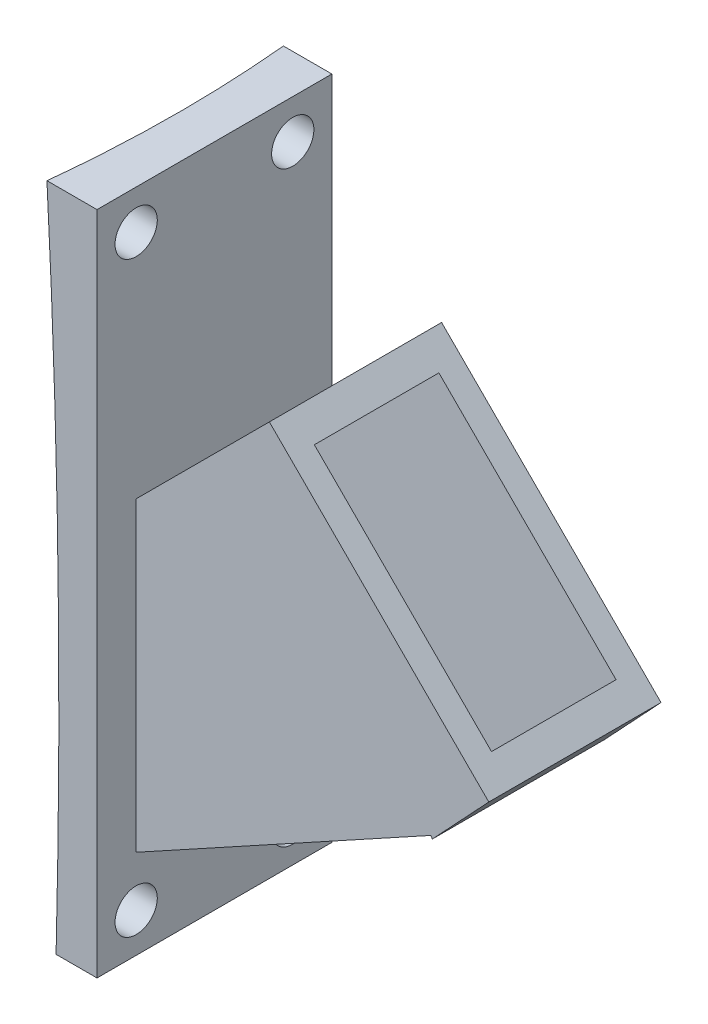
ISO-10303-21;
HEADER;
FILE_DESCRIPTION(('STEP AP214'),'2;1');
FILE_NAME('part.step','',(''),(''),'','','');
FILE_SCHEMA(('AUTOMOTIVE_DESIGN { 1 0 10303 214 1 1 1 1 }'));
ENDSEC;
DATA;
#1=APPLICATION_CONTEXT('core data for automotive mechanical design processes');
#2=APPLICATION_PROTOCOL_DEFINITION('international standard','automotive_design',2000,#1);
#3=PRODUCT_CONTEXT('',#1,'mechanical');
#4=PRODUCT('Part','Part','',(#3));
#5=PRODUCT_RELATED_PRODUCT_CATEGORY('part','',(#4));
#6=PRODUCT_DEFINITION_FORMATION('','',#4);
#7=PRODUCT_DEFINITION_CONTEXT('part definition',#1,'design');
#8=PRODUCT_DEFINITION('design','',#6,#7);
#9=PRODUCT_DEFINITION_SHAPE('','',#8);
#10=(LENGTH_UNIT() NAMED_UNIT(*) SI_UNIT(.MILLI.,.METRE.));
#11=(NAMED_UNIT(*) PLANE_ANGLE_UNIT() SI_UNIT($,.RADIAN.));
#12=(NAMED_UNIT(*) SI_UNIT($,.STERADIAN.) SOLID_ANGLE_UNIT());
#13=UNCERTAINTY_MEASURE_WITH_UNIT(LENGTH_MEASURE(1.E-05),#10,'distance_accuracy_value','');
#14=(GEOMETRIC_REPRESENTATION_CONTEXT(3) GLOBAL_UNCERTAINTY_ASSIGNED_CONTEXT((#13)) GLOBAL_UNIT_ASSIGNED_CONTEXT((#10,
#11,#12)) REPRESENTATION_CONTEXT('',''));
#15=CARTESIAN_POINT('',(0.,0.,0.));
#16=DIRECTION('',(0.,0.,1.));
#17=DIRECTION('',(1.,0.,0.));
#18=AXIS2_PLACEMENT_3D('',#15,#16,#17);
#19=CARTESIAN_POINT('',(13.8669999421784,72.7650266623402,-17.78));
#20=DIRECTION('',(1.,0.,0.));
#21=DIRECTION('',(0.,1.,0.));
#22=AXIS2_PLACEMENT_3D('',#19,#20,#21);
#23=PLANE('',#22);
#24=CARTESIAN_POINT('',(13.8669999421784,-28.8349733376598,-11.43));
#25=DIRECTION('',(1.,0.,0.));
#26=DIRECTION('',(0.,1.,0.));
#27=AXIS2_PLACEMENT_3D('',#24,#25,#26);
#28=CIRCLE('',#27,3.429);
#29=CARTESIAN_POINT('',(13.8669999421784,-25.4059733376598,-11.43));
#30=VERTEX_POINT('',#29);
#31=EDGE_CURVE('E172',#30,#30,#28,.T.);
#32=ORIENTED_EDGE('',*,*,#31,.F.);
#33=EDGE_LOOP('',(#32));
#34=FACE_BOUND('',#33,.T.);
#35=CARTESIAN_POINT('',(13.8669999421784,66.4150266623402,-11.43));
#36=DIRECTION('',(1.,0.,0.));
#37=DIRECTION('',(0.,1.,0.));
#38=AXIS2_PLACEMENT_3D('',#35,#36,#37);
#39=CIRCLE('',#38,3.429);
#40=CARTESIAN_POINT('',(13.8669999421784,69.8440266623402,-11.43));
#41=VERTEX_POINT('',#40);
#42=EDGE_CURVE('E180',#41,#41,#39,.T.);
#43=ORIENTED_EDGE('',*,*,#42,.F.);
#44=EDGE_LOOP('',(#43));
#45=FACE_BOUND('',#44,.T.);
#46=CARTESIAN_POINT('',(13.8669999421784,66.4150266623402,13.97));
#47=DIRECTION('',(1.,0.,0.));
#48=DIRECTION('',(0.,1.,0.));
#49=AXIS2_PLACEMENT_3D('',#46,#47,#48);
#50=CIRCLE('',#49,3.429);
#51=CARTESIAN_POINT('',(13.8669999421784,69.8440266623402,13.97));
#52=VERTEX_POINT('',#51);
#53=EDGE_CURVE('E176',#52,#52,#50,.T.);
#54=ORIENTED_EDGE('',*,*,#53,.F.);
#55=EDGE_LOOP('',(#54));
#56=FACE_BOUND('',#55,.T.);
#57=CARTESIAN_POINT('',(13.8669999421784,-28.8349733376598,13.97));
#58=DIRECTION('',(1.,0.,0.));
#59=DIRECTION('',(0.,1.,0.));
#60=AXIS2_PLACEMENT_3D('',#57,#58,#59);
#61=CIRCLE('',#60,3.429);
#62=CARTESIAN_POINT('',(13.8669999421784,-25.4059733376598,13.97));
#63=VERTEX_POINT('',#62);
#64=EDGE_CURVE('E179',#63,#63,#61,.T.);
#65=ORIENTED_EDGE('',*,*,#64,.F.);
#66=EDGE_LOOP('',(#65));
#67=FACE_BOUND('',#66,.T.);
#68=DIRECTION('',(0.,1.,0.));
#69=VECTOR('',#68,1.);
#70=CARTESIAN_POINT('',(13.8669999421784,72.7650266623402,20.32));
#71=LINE('',#70,#69);
#72=CARTESIAN_POINT('',(13.8669999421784,-35.1849733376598,20.32));
#73=VERTEX_POINT('',#72);
#74=CARTESIAN_POINT('',(13.8669999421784,72.7650266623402,20.32));
#75=VERTEX_POINT('',#74);
#76=EDGE_CURVE('E516',#73,#75,#71,.T.);
#77=ORIENTED_EDGE('',*,*,#76,.F.);
#78=DIRECTION('',(0.,0.,1.));
#79=VECTOR('',#78,1.);
#80=CARTESIAN_POINT('',(13.8669999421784,-35.1849733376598,-17.78));
#81=LINE('',#80,#79);
#82=CARTESIAN_POINT('',(13.8669999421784,-35.1849733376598,-17.78));
#83=VERTEX_POINT('',#82);
#84=EDGE_CURVE('E523',#83,#73,#81,.T.);
#85=ORIENTED_EDGE('',*,*,#84,.F.);
#86=DIRECTION('',(0.,1.,0.));
#87=VECTOR('',#86,1.);
#88=CARTESIAN_POINT('',(13.8669999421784,72.7650266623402,-17.78));
#89=LINE('',#88,#87);
#90=CARTESIAN_POINT('',(13.8669999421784,72.7650266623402,-17.78));
#91=VERTEX_POINT('',#90);
#92=EDGE_CURVE('E510',#83,#91,#89,.T.);
#93=ORIENTED_EDGE('',*,*,#92,.T.);
#94=DIRECTION('',(0.,0.,1.));
#95=VECTOR('',#94,1.);
#96=CARTESIAN_POINT('',(13.8669999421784,72.7650266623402,-17.78));
#97=LINE('',#96,#95);
#98=EDGE_CURVE('E505',#91,#75,#97,.T.);
#99=ORIENTED_EDGE('',*,*,#98,.T.);
#100=EDGE_LOOP('',(#77,#85,#93,#99));
#101=FACE_BOUND('',#100,.T.);
#102=DIRECTION('',(0.,-1.,0.));
#103=VECTOR('',#102,1.);
#104=CARTESIAN_POINT('',(13.8669999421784,0.,-13.97));
#105=LINE('',#104,#103);
#106=CARTESIAN_POINT('',(13.8669999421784,28.959,-13.97));
#107=VERTEX_POINT('',#106);
#108=CARTESIAN_POINT('',(13.8669999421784,-20.6945064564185,-13.97));
#109=VERTEX_POINT('',#108);
#110=EDGE_CURVE('E526',#107,#109,#105,.T.);
#111=ORIENTED_EDGE('',*,*,#110,.T.);
#112=DIRECTION('',(0.,0.,-1.));
#113=VECTOR('',#112,1.);
#114=CARTESIAN_POINT('',(13.8669999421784,-20.6945064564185,13.97));
#115=LINE('',#114,#113);
#116=CARTESIAN_POINT('',(13.8669999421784,-20.6945064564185,13.97));
#117=VERTEX_POINT('',#116);
#118=EDGE_CURVE('E329',#117,#109,#115,.T.);
#119=ORIENTED_EDGE('',*,*,#118,.F.);
#120=DIRECTION('',(0.,-1.,0.));
#121=VECTOR('',#120,1.);
#122=CARTESIAN_POINT('',(13.8669999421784,0.,13.97));
#123=LINE('',#122,#121);
#124=CARTESIAN_POINT('',(13.8669999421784,28.959,13.97));
#125=VERTEX_POINT('',#124);
#126=EDGE_CURVE('E529',#125,#117,#123,.T.);
#127=ORIENTED_EDGE('',*,*,#126,.F.);
#128=DIRECTION('',(0.,0.,-1.));
#129=VECTOR('',#128,1.);
#130=CARTESIAN_POINT('',(13.8669999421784,28.959,13.97));
#131=LINE('',#130,#129);
#132=EDGE_CURVE('E531',#125,#107,#131,.T.);
#133=ORIENTED_EDGE('',*,*,#132,.T.);
#134=EDGE_LOOP('',(#111,#119,#127,#133));
#135=FACE_BOUND('',#134,.T.);
#136=ADVANCED_FACE('F36',(#34,#45,#56,#67,#101,#135),#23,.T.);
#137=CARTESIAN_POINT('',(13.8669999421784,-35.1849733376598,-17.78));
#138=DIRECTION('',(0.,-1.,0.));
#139=DIRECTION('',(0.,0.,-1.));
#140=AXIS2_PLACEMENT_3D('',#137,#138,#139);
#141=PLANE('',#140);
#142=DIRECTION('',(1.,0.,0.));
#143=VECTOR('',#142,1.);
#144=CARTESIAN_POINT('',(13.8669999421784,-35.1849733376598,20.32));
#145=LINE('',#144,#143);
#146=CARTESIAN_POINT('',(7.22642653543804,-35.1849733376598,20.32));
#147=VERTEX_POINT('',#146);
#148=EDGE_CURVE('E513',#147,#73,#145,.T.);
#149=ORIENTED_EDGE('',*,*,#148,.F.);
#150=CARTESIAN_POINT('',(7.22642653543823,-35.1849733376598,20.32));
#151=CARTESIAN_POINT('',(7.34022612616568,-35.1849733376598,19.2632239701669));
#152=CARTESIAN_POINT('',(7.44523026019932,-35.1849733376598,18.2054996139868));
#153=CARTESIAN_POINT('',(7.6374214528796,-35.1849733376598,16.089929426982));
#154=CARTESIAN_POINT('',(7.72463329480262,-35.1849733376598,15.0320858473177));
#155=CARTESIAN_POINT('',(7.88124529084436,-35.1849733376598,12.9162772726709));
#156=CARTESIAN_POINT('',(7.95066537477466,-35.1849733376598,11.8583137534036));
#157=CARTESIAN_POINT('',(8.07170177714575,-35.1849733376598,9.74226643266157));
#158=CARTESIAN_POINT('',(8.12333310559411,-35.1849733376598,8.68418348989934));
#159=CARTESIAN_POINT('',(8.20879669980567,-35.1849733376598,6.56789781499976));
#160=CARTESIAN_POINT('',(8.24263900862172,-35.1849733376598,5.50969548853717));
#161=CARTESIAN_POINT('',(8.29252756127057,-35.1849733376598,3.39317135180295));
#162=CARTESIAN_POINT('',(8.30857884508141,-35.1849733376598,2.33484966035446));
#163=CARTESIAN_POINT('',(8.32288622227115,-35.1849733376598,0.218083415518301));
#164=CARTESIAN_POINT('',(8.32114227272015,-35.1849733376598,-0.840361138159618));
#165=CARTESIAN_POINT('',(8.29985786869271,-35.1849733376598,-2.95737001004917));
#166=CARTESIAN_POINT('',(8.28031239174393,-35.1849733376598,-4.01593427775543));
#167=CARTESIAN_POINT('',(8.22342158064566,-35.1849733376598,-6.13318229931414));
#168=CARTESIAN_POINT('',(8.18606620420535,-35.1849733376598,-7.19186578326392));
#169=CARTESIAN_POINT('',(8.0935505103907,-35.1849733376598,-9.30935212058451));
#170=CARTESIAN_POINT('',(8.03837515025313,-35.1849733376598,-10.3681543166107));
#171=CARTESIAN_POINT('',(7.91021109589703,-35.1849733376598,-12.4858777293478));
#172=CARTESIAN_POINT('',(7.83720238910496,-35.1849733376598,-13.5447977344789));
#173=CARTESIAN_POINT('',(7.6733657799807,-35.1849733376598,-15.662757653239));
#174=CARTESIAN_POINT('',(7.58251294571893,-35.1849733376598,-16.7217956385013));
#175=CARTESIAN_POINT('',(7.482821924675,-35.1849733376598,-17.7800000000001));
#176=B_SPLINE_CURVE_WITH_KNOTS('',3,(#150,#151,#152,#153,#154,#155,#156,#157,#158,#159,#160,
#161,#162,#163,#164,#165,#166,#167,#168,#169,#170,#171,#172,#173,#174,#175),.UNSPECIFIED.,.F.,
.F.,(4,2,2,2,2,2,2,2,2,2,2,2,4),(0.,3.18862189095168,6.37277149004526,9.55333855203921,
12.7312152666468,15.9072959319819,19.0824766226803,22.2576649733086,25.4337494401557,
28.6116268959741,31.7921940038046,34.9763468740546,38.1649807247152),.UNSPECIFIED.);
#177=CARTESIAN_POINT('',(7.482821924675,-35.1849733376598,-17.78));
#178=VERTEX_POINT('',#177);
#179=EDGE_CURVE('E215',#147,#178,#176,.T.);
#180=ORIENTED_EDGE('',*,*,#179,.T.);
#181=DIRECTION('',(1.,0.,0.));
#182=VECTOR('',#181,1.);
#183=CARTESIAN_POINT('',(13.8669999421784,-35.1849733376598,-17.78));
#184=LINE('',#183,#182);
#185=EDGE_CURVE('E509',#178,#83,#184,.T.);
#186=ORIENTED_EDGE('',*,*,#185,.T.);
#187=ORIENTED_EDGE('',*,*,#84,.T.);
#188=EDGE_LOOP('',(#149,#180,#186,#187));
#189=FACE_BOUND('',#188,.T.);
#190=ADVANCED_FACE('F264',(#189),#141,.T.);
#191=CARTESIAN_POINT('',(13.8669999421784,72.7650266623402,-17.78));
#192=DIRECTION('',(0.,1.,0.));
#193=DIRECTION('',(0.,0.,1.));
#194=AXIS2_PLACEMENT_3D('',#191,#192,#193);
#195=PLANE('',#194);
#196=DIRECTION('',(-1.,0.,0.));
#197=VECTOR('',#196,1.);
#198=CARTESIAN_POINT('',(13.8669999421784,72.7650266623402,-17.78));
#199=LINE('',#198,#197);
#200=CARTESIAN_POINT('',(6.00315951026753,72.7650266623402,-17.78));
#201=VERTEX_POINT('',#200);
#202=EDGE_CURVE('E502',#91,#201,#199,.T.);
#203=ORIENTED_EDGE('',*,*,#202,.T.);
#204=CARTESIAN_POINT('',(6.00315951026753,72.7650266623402,-17.78));
#205=CARTESIAN_POINT('',(6.1029581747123,72.7650266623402,-16.7217959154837));
#206=CARTESIAN_POINT('',(6.19390924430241,72.7650266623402,-15.662756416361));
#207=CARTESIAN_POINT('',(6.35792288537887,72.7650266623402,-13.5447937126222));
#208=CARTESIAN_POINT('',(6.43101046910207,72.7650266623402,-12.4858724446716));
#209=CARTESIAN_POINT('',(6.55931288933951,72.7650266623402,-10.3681467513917));
#210=CARTESIAN_POINT('',(6.61454780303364,72.7650266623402,-9.30934354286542));
#211=CARTESIAN_POINT('',(6.70716327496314,72.7650266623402,-7.19185543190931));
#212=CARTESIAN_POINT('',(6.74455892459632,72.7650266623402,-6.13317118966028));
#213=CARTESIAN_POINT('',(6.80151100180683,72.7650266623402,-4.01592190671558));
#214=CARTESIAN_POINT('',(6.82107750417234,72.7650266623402,-2.95735713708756));
#215=CARTESIAN_POINT('',(6.84238472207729,72.7650266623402,-0.840347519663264));
#216=CARTESIAN_POINT('',(6.84413047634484,72.7650266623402,0.218097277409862));
#217=CARTESIAN_POINT('',(6.82980750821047,72.7650266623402,2.33486373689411));
#218=CARTESIAN_POINT('',(6.81373882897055,72.7650266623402,3.39318539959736));
#219=CARTESIAN_POINT('',(6.76379631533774,72.7650266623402,5.50970922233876));
#220=CARTESIAN_POINT('',(6.72991742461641,72.7650266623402,6.56791126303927));
#221=CARTESIAN_POINT('',(6.64436151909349,72.7650266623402,8.68419611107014));
#222=CARTESIAN_POINT('',(6.59267442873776,72.7650266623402,9.7422785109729));
#223=CARTESIAN_POINT('',(6.4715073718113,72.7650266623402,11.8583244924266));
#224=CARTESIAN_POINT('',(6.40201234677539,72.7650266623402,12.9162872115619));
#225=CARTESIAN_POINT('',(6.2452313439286,72.7650266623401,15.0320939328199));
#226=CARTESIAN_POINT('',(6.15792537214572,72.7650266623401,16.0899364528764));
#227=CARTESIAN_POINT('',(5.96552680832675,72.7650266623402,18.2055042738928));
#228=CARTESIAN_POINT('',(5.86040935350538,72.7650266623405,19.2632273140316));
#229=CARTESIAN_POINT('',(5.74648717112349,72.7650266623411,20.32));
#230=B_SPLINE_CURVE_WITH_KNOTS('',3,(#204,#205,#206,#207,#208,#209,#210,#211,#212,#213,#214,
#215,#216,#217,#218,#219,#220,#221,#222,#223,#224,#225,#226,#227,#228,#229),.UNSPECIFIED.,.F.,
.F.,(4,2,2,2,2,2,2,2,2,2,2,2,4),(0.,3.18866325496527,6.37283587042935,9.55341499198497,
12.731298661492,15.9073854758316,19.0825742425,22.257755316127,25.4338383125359,
28.6117212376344,31.7923003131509,34.9764696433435,38.165120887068),.UNSPECIFIED.);
#231=CARTESIAN_POINT('',(5.74648717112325,72.7650266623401,20.32));
#232=VERTEX_POINT('',#231);
#233=EDGE_CURVE('E190',#201,#232,#230,.T.);
#234=ORIENTED_EDGE('',*,*,#233,.T.);
#235=DIRECTION('',(-1.,0.,0.));
#236=VECTOR('',#235,1.);
#237=CARTESIAN_POINT('',(13.8669999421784,72.7650266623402,20.32));
#238=LINE('',#237,#236);
#239=EDGE_CURVE('E519',#75,#232,#238,.T.);
#240=ORIENTED_EDGE('',*,*,#239,.F.);
#241=ORIENTED_EDGE('',*,*,#98,.F.);
#242=EDGE_LOOP('',(#203,#234,#240,#241));
#243=FACE_BOUND('',#242,.T.);
#244=ADVANCED_FACE('F270',(#243),#195,.T.);
#245=CARTESIAN_POINT('',(0.,0.,-17.78));
#246=DIRECTION('',(0.,0.,-1.));
#247=DIRECTION('',(-1.,0.,0.));
#248=AXIS2_PLACEMENT_3D('',#245,#246,#247);
#249=PLANE('',#248);
#250=ORIENTED_EDGE('',*,*,#185,.F.);
#251=CARTESIAN_POINT('',(-1364.09900570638,0.,-17.78));
#252=DIRECTION('',(0.,0.,-1.));
#253=DIRECTION('',(-1.,0.,0.));
#254=AXIS2_PLACEMENT_3D('',#251,#252,#253);
#255=CIRCLE('',#254,1372.03305070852);
#256=EDGE_CURVE('E520',#178,#201,#255,.F.);
#257=ORIENTED_EDGE('',*,*,#256,.T.);
#258=ORIENTED_EDGE('',*,*,#202,.F.);
#259=ORIENTED_EDGE('',*,*,#92,.F.);
#260=EDGE_LOOP('',(#250,#257,#258,#259));
#261=FACE_BOUND('',#260,.T.);
#262=ADVANCED_FACE('F208',(#261),#249,.T.);
#263=CARTESIAN_POINT('',(0.,0.,20.32));
#264=DIRECTION('',(0.,0.,-1.));
#265=DIRECTION('',(-1.,0.,0.));
#266=AXIS2_PLACEMENT_3D('',#263,#264,#265);
#267=PLANE('',#266);
#268=CARTESIAN_POINT('',(-1364.09900570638,0.,20.32));
#269=DIRECTION('',(0.,0.,-1.));
#270=DIRECTION('',(-1.,0.,0.));
#271=AXIS2_PLACEMENT_3D('',#268,#269,#270);
#272=CIRCLE('',#271,1371.77673965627);
#273=EDGE_CURVE('E331',#147,#232,#272,.F.);
#274=ORIENTED_EDGE('',*,*,#273,.F.);
#275=ORIENTED_EDGE('',*,*,#148,.T.);
#276=ORIENTED_EDGE('',*,*,#76,.T.);
#277=ORIENTED_EDGE('',*,*,#239,.T.);
#278=EDGE_LOOP('',(#274,#275,#276,#277));
#279=FACE_BOUND('',#278,.T.);
#280=ADVANCED_FACE('F294',(#279),#267,.F.);
#281=CARTESIAN_POINT('',(71.0710749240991,14.9684617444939,13.97));
#282=DIRECTION('',(0.730018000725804,-0.683427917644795,0.));
#283=DIRECTION('',(0.683427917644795,0.730018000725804,0.));
#284=AXIS2_PLACEMENT_3D('',#281,#282,#283);
#285=PLANE('',#284);
#286=DIRECTION('',(0.,0.,1.));
#287=VECTOR('',#286,1.);
#288=CARTESIAN_POINT('',(61.9099897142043,5.1828546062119,13.97));
#289=LINE('',#288,#287);
#290=CARTESIAN_POINT('',(61.9099897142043,5.18285460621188,-13.97));
#291=VERTEX_POINT('',#290);
#292=CARTESIAN_POINT('',(61.9099897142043,5.18285460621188,13.97));
#293=VERTEX_POINT('',#292);
#294=EDGE_CURVE('E320',#291,#293,#289,.T.);
#295=ORIENTED_EDGE('',*,*,#294,.F.);
#296=DIRECTION('',(-0.683427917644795,-0.730018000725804,0.));
#297=VECTOR('',#296,1.);
#298=CARTESIAN_POINT('',(71.0710749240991,14.9684617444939,-13.97));
#299=LINE('',#298,#297);
#300=CARTESIAN_POINT('',(71.0710749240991,14.9684617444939,-13.97));
#301=VERTEX_POINT('',#300);
#302=EDGE_CURVE('E315',#301,#291,#299,.T.);
#303=ORIENTED_EDGE('',*,*,#302,.F.);
#304=DIRECTION('',(0.,0.,-1.));
#305=VECTOR('',#304,1.);
#306=CARTESIAN_POINT('',(71.0710749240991,14.9684617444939,13.97));
#307=LINE('',#306,#305);
#308=CARTESIAN_POINT('',(71.0710749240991,14.9684617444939,13.97));
#309=VERTEX_POINT('',#308);
#310=EDGE_CURVE('E312',#309,#301,#307,.T.);
#311=ORIENTED_EDGE('',*,*,#310,.F.);
#312=DIRECTION('',(-0.683427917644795,-0.730018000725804,0.));
#313=VECTOR('',#312,1.);
#314=CARTESIAN_POINT('',(71.0710749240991,14.9684617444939,13.97));
#315=LINE('',#314,#313);
#316=EDGE_CURVE('E327',#309,#293,#315,.T.);
#317=ORIENTED_EDGE('',*,*,#316,.T.);
#318=EDGE_LOOP('',(#295,#303,#311,#317));
#319=FACE_BOUND('',#318,.T.);
#320=ADVANCED_FACE('F291',(#319),#285,.T.);
#321=CARTESIAN_POINT('',(35.4737683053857,50.5657683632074,13.97));
#322=DIRECTION('',(0.707106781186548,0.707106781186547,0.));
#323=DIRECTION('',(-0.707106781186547,0.707106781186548,0.));
#324=AXIS2_PLACEMENT_3D('',#321,#322,#323);
#325=PLANE('',#324);
#326=DIRECTION('',(-0.707106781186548,0.707106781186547,0.));
#327=VECTOR('',#326,1.);
#328=CARTESIAN_POINT('',(38.9040118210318,47.1355248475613,-10.10031));
#329=LINE('',#328,#327);
#330=CARTESIAN_POINT('',(67.6408314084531,18.39870526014,-10.10031));
#331=VERTEX_POINT('',#330);
#332=CARTESIAN_POINT('',(38.9040118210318,47.1355248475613,-10.10031));
#333=VERTEX_POINT('',#332);
#334=EDGE_CURVE('E51',#331,#333,#329,.T.);
#335=ORIENTED_EDGE('',*,*,#334,.F.);
#336=DIRECTION('',(0.,0.,-1.));
#337=VECTOR('',#336,1.);
#338=CARTESIAN_POINT('',(67.6408314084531,18.39870526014,10.10031));
#339=LINE('',#338,#337);
#340=CARTESIAN_POINT('',(67.6408314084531,18.39870526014,10.10031));
#341=VERTEX_POINT('',#340);
#342=EDGE_CURVE('E149',#341,#331,#339,.T.);
#343=ORIENTED_EDGE('',*,*,#342,.F.);
#344=DIRECTION('',(0.707106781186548,-0.707106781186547,0.));
#345=VECTOR('',#344,1.);
#346=CARTESIAN_POINT('',(38.9040118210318,47.1355248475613,10.10031));
#347=LINE('',#346,#345);
#348=CARTESIAN_POINT('',(38.9040118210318,47.1355248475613,10.10031));
#349=VERTEX_POINT('',#348);
#350=EDGE_CURVE('E165',#349,#341,#347,.T.);
#351=ORIENTED_EDGE('',*,*,#350,.F.);
#352=DIRECTION('',(0.,0.,1.));
#353=VECTOR('',#352,1.);
#354=CARTESIAN_POINT('',(38.9040118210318,47.1355248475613,10.10031));
#355=LINE('',#354,#353);
#356=EDGE_CURVE('E163',#333,#349,#355,.T.);
#357=ORIENTED_EDGE('',*,*,#356,.F.);
#358=EDGE_LOOP('',(#335,#343,#351,#357));
#359=FACE_BOUND('',#358,.T.);
#360=DIRECTION('',(0.707106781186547,-0.707106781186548,0.));
#361=VECTOR('',#360,1.);
#362=CARTESIAN_POINT('',(35.4737683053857,50.5657683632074,-13.97));
#363=LINE('',#362,#361);
#364=CARTESIAN_POINT('',(35.4737683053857,50.5657683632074,-13.97));
#365=VERTEX_POINT('',#364);
#366=EDGE_CURVE('E307',#365,#301,#363,.T.);
#367=ORIENTED_EDGE('',*,*,#366,.F.);
#368=DIRECTION('',(0.,0.,-1.));
#369=VECTOR('',#368,1.);
#370=CARTESIAN_POINT('',(35.4737683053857,50.5657683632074,13.97));
#371=LINE('',#370,#369);
#372=CARTESIAN_POINT('',(35.4737683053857,50.5657683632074,13.97));
#373=VERTEX_POINT('',#372);
#374=EDGE_CURVE('E310',#373,#365,#371,.T.);
#375=ORIENTED_EDGE('',*,*,#374,.F.);
#376=DIRECTION('',(0.707106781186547,-0.707106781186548,0.));
#377=VECTOR('',#376,1.);
#378=CARTESIAN_POINT('',(35.4737683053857,50.5657683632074,13.97));
#379=LINE('',#378,#377);
#380=EDGE_CURVE('E546',#373,#309,#379,.T.);
#381=ORIENTED_EDGE('',*,*,#380,.T.);
#382=ORIENTED_EDGE('',*,*,#310,.T.);
#383=EDGE_LOOP('',(#367,#375,#381,#382));
#384=FACE_BOUND('',#383,.T.);
#385=ADVANCED_FACE('F293',(#359,#384),#325,.T.);
#386=CARTESIAN_POINT('',(8.53299994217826,23.6249999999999,13.97));
#387=DIRECTION('',(-0.707106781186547,0.707106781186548,0.));
#388=DIRECTION('',(-0.707106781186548,-0.707106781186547,0.));
#389=AXIS2_PLACEMENT_3D('',#386,#387,#388);
#390=PLANE('',#389);
#391=ORIENTED_EDGE('',*,*,#132,.F.);
#392=DIRECTION('',(0.707106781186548,0.707106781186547,0.));
#393=VECTOR('',#392,1.);
#394=CARTESIAN_POINT('',(8.53299994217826,23.6249999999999,13.97));
#395=LINE('',#394,#393);
#396=EDGE_CURVE('E318',#125,#373,#395,.T.);
#397=ORIENTED_EDGE('',*,*,#396,.T.);
#398=ORIENTED_EDGE('',*,*,#374,.T.);
#399=DIRECTION('',(0.707106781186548,0.707106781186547,0.));
#400=VECTOR('',#399,1.);
#401=CARTESIAN_POINT('',(8.53299994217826,23.6249999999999,-13.97));
#402=LINE('',#401,#400);
#403=EDGE_CURVE('E316',#107,#365,#402,.T.);
#404=ORIENTED_EDGE('',*,*,#403,.F.);
#405=EDGE_LOOP('',(#391,#397,#398,#404));
#406=FACE_BOUND('',#405,.T.);
#407=ADVANCED_FACE('F38',(#406),#390,.T.);
#408=CARTESIAN_POINT('',(0.,0.,13.97));
#409=DIRECTION('',(0.,0.,-1.));
#410=DIRECTION('',(-1.,0.,0.));
#411=AXIS2_PLACEMENT_3D('',#408,#409,#410);
#412=PLANE('',#411);
#413=ORIENTED_EDGE('',*,*,#126,.T.);
#414=DIRECTION('',(0.876438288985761,0.48151420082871,0.));
#415=VECTOR('',#414,1.);
#416=CARTESIAN_POINT('',(61.6722651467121,5.5696519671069,13.97));
#417=LINE('',#416,#415);
#418=CARTESIAN_POINT('',(61.6722651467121,5.5696519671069,13.97));
#419=VERTEX_POINT('',#418);
#420=EDGE_CURVE('E538',#117,#419,#417,.T.);
#421=ORIENTED_EDGE('',*,*,#420,.T.);
#422=DIRECTION('',(0.523610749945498,-0.851957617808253,0.));
#423=VECTOR('',#422,1.);
#424=CARTESIAN_POINT('',(79.6160038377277,-23.626281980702,13.97));
#425=LINE('',#424,#423);
#426=EDGE_CURVE('E535',#419,#293,#425,.T.);
#427=ORIENTED_EDGE('',*,*,#426,.T.);
#428=ORIENTED_EDGE('',*,*,#316,.F.);
#429=ORIENTED_EDGE('',*,*,#380,.F.);
#430=ORIENTED_EDGE('',*,*,#396,.F.);
#431=EDGE_LOOP('',(#413,#421,#427,#428,#429,#430));
#432=FACE_BOUND('',#431,.T.);
#433=ADVANCED_FACE('F284',(#432),#412,.F.);
#434=CARTESIAN_POINT('',(0.,0.,-13.97));
#435=DIRECTION('',(0.,0.,-1.));
#436=DIRECTION('',(-1.,0.,0.));
#437=AXIS2_PLACEMENT_3D('',#434,#435,#436);
#438=PLANE('',#437);
#439=ORIENTED_EDGE('',*,*,#110,.F.);
#440=ORIENTED_EDGE('',*,*,#403,.T.);
#441=ORIENTED_EDGE('',*,*,#366,.T.);
#442=ORIENTED_EDGE('',*,*,#302,.T.);
#443=DIRECTION('',(0.523610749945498,-0.851957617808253,0.));
#444=VECTOR('',#443,1.);
#445=CARTESIAN_POINT('',(79.6160038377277,-23.626281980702,-13.97));
#446=LINE('',#445,#444);
#447=CARTESIAN_POINT('',(61.6722651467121,5.5696519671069,-13.97));
#448=VERTEX_POINT('',#447);
#449=EDGE_CURVE('E533',#448,#291,#446,.T.);
#450=ORIENTED_EDGE('',*,*,#449,.F.);
#451=DIRECTION('',(0.876438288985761,0.48151420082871,0.));
#452=VECTOR('',#451,1.);
#453=CARTESIAN_POINT('',(11.9485896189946,-21.7484789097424,-13.97));
#454=LINE('',#453,#452);
#455=EDGE_CURVE('E325',#109,#448,#454,.T.);
#456=ORIENTED_EDGE('',*,*,#455,.F.);
#457=EDGE_LOOP('',(#439,#440,#441,#442,#450,#456));
#458=FACE_BOUND('',#457,.T.);
#459=ADVANCED_FACE('F279',(#458),#438,.T.);
#460=CARTESIAN_POINT('',(61.6722651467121,5.5696519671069,13.97));
#461=DIRECTION('',(-0.48151420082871,0.876438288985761,0.));
#462=DIRECTION('',(-0.876438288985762,-0.48151420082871,0.));
#463=AXIS2_PLACEMENT_3D('',#460,#461,#462);
#464=PLANE('',#463);
#465=DIRECTION('',(0.,0.,-1.));
#466=VECTOR('',#465,1.);
#467=CARTESIAN_POINT('',(46.4470770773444,-2.79504907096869,13.97));
#468=LINE('',#467,#466);
#469=CARTESIAN_POINT('',(46.4470770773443,-2.79504907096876,10.10031));
#470=VERTEX_POINT('',#469);
#471=CARTESIAN_POINT('',(46.4470770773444,-2.79504907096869,-10.10031));
#472=VERTEX_POINT('',#471);
#473=EDGE_CURVE('E44',#470,#472,#468,.T.);
#474=ORIENTED_EDGE('',*,*,#473,.T.);
#475=DIRECTION('',(-0.876438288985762,-0.48151420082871,0.));
#476=VECTOR('',#475,1.);
#477=CARTESIAN_POINT('',(61.6722651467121,5.5696519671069,-10.10031));
#478=LINE('',#477,#476);
#479=CARTESIAN_POINT('',(39.0286980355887,-6.87069809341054,-10.10031));
#480=VERTEX_POINT('',#479);
#481=EDGE_CURVE('E11',#472,#480,#478,.T.);
#482=ORIENTED_EDGE('',*,*,#481,.T.);
#483=DIRECTION('',(0.,0.,-1.));
#484=VECTOR('',#483,1.);
#485=CARTESIAN_POINT('',(39.0286980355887,-6.87069809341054,13.97));
#486=LINE('',#485,#484);
#487=CARTESIAN_POINT('',(39.0286980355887,-6.87069809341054,10.10031));
#488=VERTEX_POINT('',#487);
#489=EDGE_CURVE('E148',#488,#480,#486,.T.);
#490=ORIENTED_EDGE('',*,*,#489,.F.);
#491=DIRECTION('',(0.876438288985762,0.48151420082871,0.));
#492=VECTOR('',#491,1.);
#493=CARTESIAN_POINT('',(61.6722651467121,5.5696519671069,10.10031));
#494=LINE('',#493,#492);
#495=EDGE_CURVE('E335',#488,#470,#494,.T.);
#496=ORIENTED_EDGE('',*,*,#495,.T.);
#497=EDGE_LOOP('',(#474,#482,#490,#496));
#498=FACE_BOUND('',#497,.T.);
#499=ORIENTED_EDGE('',*,*,#118,.T.);
#500=ORIENTED_EDGE('',*,*,#455,.T.);
#501=DIRECTION('',(0.,0.,-1.));
#502=VECTOR('',#501,1.);
#503=CARTESIAN_POINT('',(61.6722651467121,5.5696519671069,13.97));
#504=LINE('',#503,#502);
#505=EDGE_CURVE('E541',#419,#448,#504,.T.);
#506=ORIENTED_EDGE('',*,*,#505,.F.);
#507=ORIENTED_EDGE('',*,*,#420,.F.);
#508=EDGE_LOOP('',(#499,#500,#506,#507));
#509=FACE_BOUND('',#508,.T.);
#510=ADVANCED_FACE('F276',(#498,#509),#464,.F.);
#511=CARTESIAN_POINT('',(79.6160038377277,-23.626281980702,13.97));
#512=DIRECTION('',(0.851957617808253,0.523610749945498,0.));
#513=DIRECTION('',(-0.523610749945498,0.851957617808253,0.));
#514=AXIS2_PLACEMENT_3D('',#511,#512,#513);
#515=PLANE('',#514);
#516=ORIENTED_EDGE('',*,*,#294,.T.);
#517=ORIENTED_EDGE('',*,*,#426,.F.);
#518=ORIENTED_EDGE('',*,*,#505,.T.);
#519=ORIENTED_EDGE('',*,*,#449,.T.);
#520=EDGE_LOOP('',(#516,#517,#518,#519));
#521=FACE_BOUND('',#520,.T.);
#522=ADVANCED_FACE('F204',(#521),#515,.F.);
#523=CARTESIAN_POINT('',(-1364.09900570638,0.,0.));
#524=DIRECTION('',(0.,1.,0.));
#525=DIRECTION('',(1.,0.,0.));
#526=AXIS2_PLACEMENT_3D('',#523,#524,#525);
#527=ELLIPSE('',#526,1372.87,509.27);
#528=TRIMMED_CURVE('',#527,(PARAMETER_VALUE(4.71238898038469)),
(PARAMETER_VALUE(7.85398163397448)),.T.,.PARAMETER.);
#529=CARTESIAN_POINT('',(-1364.09900570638,0.,-509.27));
#530=DIRECTION('',(0.,0.,-1.));
#531=AXIS1_PLACEMENT('',#529,#530);
#532=SURFACE_OF_REVOLUTION('',#528,#531);
#533=CARTESIAN_POINT('',(8.19001653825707,-25.4059733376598,-11.43));
#534=CARTESIAN_POINT('',(8.17832953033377,-25.4059819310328,-11.6230721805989));
#535=CARTESIAN_POINT('',(8.16603520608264,-25.4223345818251,-11.8162495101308));
#536=CARTESIAN_POINT('',(8.14060734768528,-25.4873090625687,-12.1972092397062));
#537=CARTESIAN_POINT('',(8.12747280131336,-25.5359705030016,-12.3849847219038));
#538=CARTESIAN_POINT('',(8.10081646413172,-25.6641554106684,-12.7495665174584));
#539=CARTESIAN_POINT('',(8.08729488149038,-25.7436625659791,-12.9263785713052));
#540=CARTESIAN_POINT('',(8.06034273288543,-25.9312623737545,-13.2640686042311));
#541=CARTESIAN_POINT('',(8.04691214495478,-26.0393478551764,-13.4249505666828));
#542=CARTESIAN_POINT('',(8.02062952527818,-26.281147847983,-13.7263823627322));
#543=CARTESIAN_POINT('',(8.00777790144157,-26.414880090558,-13.8669180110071));
#544=CARTESIAN_POINT('',(7.98315841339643,-26.7041559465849,-14.1235182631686));
#545=CARTESIAN_POINT('',(7.9713905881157,-26.8597003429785,-14.2395819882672));
#546=CARTESIAN_POINT('',(7.94941484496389,-27.1879846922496,-14.443766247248));
#547=CARTESIAN_POINT('',(7.93920496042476,-27.3607025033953,-14.5319221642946));
#548=CARTESIAN_POINT('',(7.92072601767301,-27.7185991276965,-14.6779378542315));
#549=CARTESIAN_POINT('',(7.91245692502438,-27.9037777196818,-14.7357981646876));
#550=CARTESIAN_POINT('',(7.8981934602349,-28.2807753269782,-14.8194068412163));
#551=CARTESIAN_POINT('',(7.89219264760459,-28.472573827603,-14.8452466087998));
#552=CARTESIAN_POINT('',(7.88264049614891,-28.8578459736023,-14.8643435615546));
#553=CARTESIAN_POINT('',(7.87908911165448,-29.0513195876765,-14.8576013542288));
#554=CARTESIAN_POINT('',(7.87453615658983,-29.4338958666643,-14.8117672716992));
#555=CARTESIAN_POINT('',(7.87352773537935,-29.6230089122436,-14.7727626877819));
#556=CARTESIAN_POINT('',(7.87401918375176,-29.9920224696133,-14.6636200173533));
#557=CARTESIAN_POINT('',(7.87551903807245,-30.1719230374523,-14.5934821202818));
#558=CARTESIAN_POINT('',(7.88089442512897,-30.5172546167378,-14.4241479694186));
#559=CARTESIAN_POINT('',(7.88476794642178,-30.682697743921,-14.3249763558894));
#560=CARTESIAN_POINT('',(7.89466459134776,-30.9946117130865,-14.1003814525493));
#561=CARTESIAN_POINT('',(7.90068772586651,-31.1410824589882,-13.9749580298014));
#562=CARTESIAN_POINT('',(7.91459425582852,-31.4111124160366,-13.7012455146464));
#563=CARTESIAN_POINT('',(7.92248010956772,-31.5346409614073,-13.5529262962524));
#564=CARTESIAN_POINT('',(7.93975694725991,-31.7550834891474,-13.2377558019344));
#565=CARTESIAN_POINT('',(7.94914795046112,-31.8519971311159,-13.0709042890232));
#566=CARTESIAN_POINT('',(7.9690817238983,-32.0167036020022,-12.7229689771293));
#567=CARTESIAN_POINT('',(7.97962720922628,-32.0844258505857,-12.5418519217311));
#568=CARTESIAN_POINT('',(8.00146794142,-32.1885203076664,-12.1708654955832));
#569=CARTESIAN_POINT('',(8.01276319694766,-32.224892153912,-11.9809960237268));
#570=CARTESIAN_POINT('',(8.03575969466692,-32.2653148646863,-11.597483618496));
#571=CARTESIAN_POINT('',(8.04746170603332,-32.2693007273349,-11.4038338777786));
#572=CARTESIAN_POINT('',(8.07091311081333,-32.2446738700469,-11.0186209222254));
#573=CARTESIAN_POINT('',(8.08266250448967,-32.2160609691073,-10.8270577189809));
#574=CARTESIAN_POINT('',(8.10592265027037,-32.1270088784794,-10.4513003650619));
#575=CARTESIAN_POINT('',(8.1174332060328,-32.0665445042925,-10.2671121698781));
#576=CARTESIAN_POINT('',(8.13995577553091,-31.9154817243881,-9.91150465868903));
#577=CARTESIAN_POINT('',(8.15096778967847,-31.8248833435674,-9.74008533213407));
#578=CARTESIAN_POINT('',(8.17228331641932,-31.6161516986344,-9.41495811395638));
#579=CARTESIAN_POINT('',(8.18258707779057,-31.49802816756,-9.26124399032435));
#580=CARTESIAN_POINT('',(8.20232212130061,-31.2375740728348,-8.97584592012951));
#581=CARTESIAN_POINT('',(8.21175340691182,-31.0952436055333,-8.84416188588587));
#582=CARTESIAN_POINT('',(8.22959485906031,-30.7905674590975,-8.60671142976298));
#583=CARTESIAN_POINT('',(8.23800603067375,-30.6282418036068,-8.50091939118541));
#584=CARTESIAN_POINT('',(8.25369662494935,-30.2880719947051,-8.31811508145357));
#585=CARTESIAN_POINT('',(8.26097605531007,-30.1102279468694,-8.24110261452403));
#586=CARTESIAN_POINT('',(8.27428173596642,-29.7442975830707,-8.11814517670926));
#587=CARTESIAN_POINT('',(8.28030946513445,-29.5562236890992,-8.07216339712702));
#588=CARTESIAN_POINT('',(8.29101009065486,-29.1749859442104,-8.01244842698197));
#589=CARTESIAN_POINT('',(8.29568299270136,-28.981822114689,-7.99871510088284));
#590=CARTESIAN_POINT('',(8.3035540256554,-28.5961241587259,-8.00390201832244));
#591=CARTESIAN_POINT('',(8.30675383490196,-28.4035895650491,-8.02278498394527));
#592=CARTESIAN_POINT('',(8.31156993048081,-28.0244029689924,-8.09260873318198));
#593=CARTESIAN_POINT('',(8.31318622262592,-27.8377509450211,-8.1435493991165));
#594=CARTESIAN_POINT('',(8.31472268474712,-27.4758073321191,-8.27598495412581));
#595=CARTESIAN_POINT('',(8.31464440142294,-27.3005055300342,-8.35745191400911));
#596=CARTESIAN_POINT('',(8.31269932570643,-26.9660639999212,-8.5486260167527));
#597=CARTESIAN_POINT('',(8.31083261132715,-26.8069235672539,-8.65833192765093));
#598=CARTESIAN_POINT('',(8.30524570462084,-26.5093999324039,-8.90278807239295));
#599=CARTESIAN_POINT('',(8.30152657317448,-26.3710049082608,-9.03752394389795));
#600=CARTESIAN_POINT('',(8.29221194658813,-26.1187462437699,-9.32828665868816));
#601=CARTESIAN_POINT('',(8.28661598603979,-26.0048886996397,-9.48431877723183));
#602=CARTESIAN_POINT('',(8.27358175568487,-25.8048744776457,-9.81332056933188));
#603=CARTESIAN_POINT('',(8.26614191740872,-25.7187415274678,-9.98630458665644));
#604=CARTESIAN_POINT('',(8.24953711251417,-25.5767980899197,-10.3440514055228));
#605=CARTESIAN_POINT('',(8.24037421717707,-25.5209515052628,-10.5287998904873));
#606=CARTESIAN_POINT('',(8.22426339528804,-25.4560474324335,-10.8339352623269));
#607=CARTESIAN_POINT('',(8.21778002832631,-25.4372905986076,-10.9523716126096));
#608=CARTESIAN_POINT('',(8.20428117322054,-25.4122508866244,-11.190525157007));
#609=CARTESIAN_POINT('',(8.19726568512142,-25.4059680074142,-11.3102423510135));
#610=CARTESIAN_POINT('',(8.19001653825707,-25.4059733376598,-11.43));
#611=B_SPLINE_CURVE_WITH_KNOTS('',3,(#533,#534,#535,#536,#537,#538,#539,#540,#541,#542,#543,
#544,#545,#546,#547,#548,#549,#550,#551,#552,#553,#554,#555,#556,#557,#558,#559,#560,#561,#562,
#563,#564,#565,#566,#567,#568,#569,#570,#571,#572,#573,#574,#575,#576,#577,#578,#579,#580,#581,
#582,#583,#584,#585,#586,#587,#588,#589,#590,#591,#592,#593,#594,#595,#596,#597,#598,#599,#600,
#601,#602,#603,#604,#605,#606,#607,#608,#609,#610),.UNSPECIFIED.,.T.,.F.,(4,2,2,2,2,2,2,2,2,2,2,
2,2,2,2,2,2,2,2,2,2,2,2,2,2,2,2,2,2,2,2,2,2,2,2,2,2,2,4),(0.,0.579838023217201,1.16038824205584,
1.74063187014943,2.32073003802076,2.90123071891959,3.48175224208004,4.06153477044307,
4.64130701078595,5.21942047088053,5.79752315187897,6.37406677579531,6.950606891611,
7.52665912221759,8.1027142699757,8.67953394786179,9.2563610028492,9.83457501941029,
10.4127957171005,10.9921766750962,11.5715608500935,12.151403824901,12.7312463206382,
13.3108840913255,13.8905195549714,14.4695792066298,15.0486349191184,15.6270025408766,
16.2053677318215,16.7830723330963,17.36077481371,17.9379500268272,18.5151000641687,
19.0919199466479,19.6688829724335,20.2463384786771,20.8231042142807,21.1827626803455,
21.5424211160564),.UNSPECIFIED.);
#612=CARTESIAN_POINT('',(8.19001653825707,-25.4059733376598,-11.43));
#613=VERTEX_POINT('',#612);
#614=EDGE_CURVE('E241',#613,#613,#611,.T.);
#615=ORIENTED_EDGE('',*,*,#614,.F.);
#616=EDGE_LOOP('',(#615));
#617=FACE_BOUND('',#616,.T.);
#618=CARTESIAN_POINT('',(6.64693574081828,69.84402666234,-11.4300000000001));
#619=CARTESIAN_POINT('',(6.63527075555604,69.8440182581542,-11.6225014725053));
#620=CARTESIAN_POINT('',(6.62412642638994,69.8277626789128,-11.8151722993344));
#621=CARTESIAN_POINT('',(6.60322592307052,69.7631053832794,-12.1952833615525));
#622=CARTESIAN_POINT('',(6.59347139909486,69.7146658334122,-12.3827171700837));
#623=CARTESIAN_POINT('',(6.57570558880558,69.5869724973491,-12.7468095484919));
#624=CARTESIAN_POINT('',(6.56769366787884,69.5077299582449,-12.9234720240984));
#625=CARTESIAN_POINT('',(6.5537389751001,69.3206678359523,-13.2609869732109));
#626=CARTESIAN_POINT('',(6.54779568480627,69.2128554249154,-13.4218434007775));
#627=CARTESIAN_POINT('',(6.53827567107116,68.9719132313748,-13.7229188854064));
#628=CARTESIAN_POINT('',(6.53469462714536,68.8388302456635,-13.8631752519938));
#629=CARTESIAN_POINT('',(6.53011445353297,68.5509883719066,-14.1193929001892));
#630=CARTESIAN_POINT('',(6.52911538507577,68.3962289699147,-14.2353536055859));
#631=CARTESIAN_POINT('',(6.529851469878,68.0698273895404,-14.4394246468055));
#632=CARTESIAN_POINT('',(6.53158035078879,67.8982247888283,-14.5275983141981));
#633=CARTESIAN_POINT('',(6.53781455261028,67.542725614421,-14.6739614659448));
#634=CARTESIAN_POINT('',(6.54231984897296,67.3588291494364,-14.732151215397));
#635=CARTESIAN_POINT('',(6.55404699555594,66.9840618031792,-14.8169059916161));
#636=CARTESIAN_POINT('',(6.56126760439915,66.7931941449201,-14.843485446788));
#637=CARTESIAN_POINT('',(6.57825177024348,66.4098156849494,-14.8643658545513));
#638=CARTESIAN_POINT('',(6.58801534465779,66.2173048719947,-14.8586665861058));
#639=CARTESIAN_POINT('',(6.60982107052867,65.8356608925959,-14.8151648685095));
#640=CARTESIAN_POINT('',(6.62186804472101,65.6465358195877,-14.7772938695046));
#641=CARTESIAN_POINT('',(6.64783359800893,65.2774054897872,-14.6704903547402));
#642=CARTESIAN_POINT('',(6.66175221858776,65.097400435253,-14.6015571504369));
#643=CARTESIAN_POINT('',(6.69103906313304,64.7508655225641,-14.4342916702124));
#644=CARTESIAN_POINT('',(6.70641273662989,64.5843910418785,-14.3358456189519));
#645=CARTESIAN_POINT('',(6.73801556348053,64.2703702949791,-14.1124651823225));
#646=CARTESIAN_POINT('',(6.75424473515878,64.1228244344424,-13.987530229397));
#647=CARTESIAN_POINT('',(6.78703156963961,63.8503209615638,-13.7142266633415));
#648=CARTESIAN_POINT('',(6.80359017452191,63.7254432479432,-13.5657784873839));
#649=CARTESIAN_POINT('',(6.83638458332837,63.5024391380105,-13.2499571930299));
#650=CARTESIAN_POINT('',(6.85262038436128,63.4043129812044,-13.0825839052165));
#651=CARTESIAN_POINT('',(6.88420917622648,63.237540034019,-12.7334845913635));
#652=CARTESIAN_POINT('',(6.89956139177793,63.1689188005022,-12.5517462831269));
#653=CARTESIAN_POINT('',(6.92884306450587,63.0632757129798,-12.1791954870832));
#654=CARTESIAN_POINT('',(6.94277253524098,63.0262535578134,-11.9883830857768));
#655=CARTESIAN_POINT('',(6.9687305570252,62.9849695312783,-11.6035447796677));
#656=CARTESIAN_POINT('',(6.98076322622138,62.9806357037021,-11.4095268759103));
#657=CARTESIAN_POINT('',(7.00261112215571,63.0047277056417,-11.0234087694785));
#658=CARTESIAN_POINT('',(7.01242639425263,63.0331528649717,-10.8313085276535));
#659=CARTESIAN_POINT('',(7.02955964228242,63.1218390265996,-10.4552495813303));
#660=CARTESIAN_POINT('',(7.03688684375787,63.1819802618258,-10.2712630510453));
#661=CARTESIAN_POINT('',(7.04895826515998,63.3323541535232,-9.91593716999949));
#662=CARTESIAN_POINT('',(7.05370253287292,63.4225862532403,-9.7445975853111));
#663=CARTESIAN_POINT('',(7.06056633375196,63.630270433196,-9.41997776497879));
#664=CARTESIAN_POINT('',(7.06269381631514,63.74763878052,-9.26664412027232));
#665=CARTESIAN_POINT('',(7.06441291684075,64.006416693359,-8.98180409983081));
#666=CARTESIAN_POINT('',(7.06400455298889,64.1478260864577,-8.85029756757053));
#667=CARTESIAN_POINT('',(7.06079352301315,64.4505164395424,-8.6129638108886));
#668=CARTESIAN_POINT('',(7.0579931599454,64.6117781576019,-8.50711201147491));
#669=CARTESIAN_POINT('',(7.05019928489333,64.9497010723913,-8.32390902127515));
#670=CARTESIAN_POINT('',(7.04520576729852,65.1263623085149,-8.24655790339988));
#671=CARTESIAN_POINT('',(7.0332563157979,65.4902664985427,-8.12245481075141));
#672=CARTESIAN_POINT('',(7.02629833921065,65.6775203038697,-8.07573485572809));
#673=CARTESIAN_POINT('',(7.01068097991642,66.0571377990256,-8.01431142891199));
#674=CARTESIAN_POINT('',(7.00202157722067,66.2495015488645,-7.99960833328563));
#675=CARTESIAN_POINT('',(6.98324729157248,66.6343077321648,-8.0026023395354));
#676=CARTESIAN_POINT('',(6.97312940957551,66.8267494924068,-8.02036710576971));
#677=CARTESIAN_POINT('',(6.95171573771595,67.2058676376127,-8.0878920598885));
#678=CARTESIAN_POINT('',(6.94041993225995,67.3925439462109,-8.1376526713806));
#679=CARTESIAN_POINT('',(6.91688090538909,67.7552575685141,-8.26787542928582));
#680=CARTESIAN_POINT('',(6.90463568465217,67.9312709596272,-8.34840384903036));
#681=CARTESIAN_POINT('',(6.87946949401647,68.2672332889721,-8.53784503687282));
#682=CARTESIAN_POINT('',(6.86654854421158,68.4271827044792,-8.64675696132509));
#683=CARTESIAN_POINT('',(6.84025641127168,68.7267331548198,-8.89005068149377));
#684=CARTESIAN_POINT('',(6.82688457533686,68.8663029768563,-9.02447083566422));
#685=CARTESIAN_POINT('',(6.79995536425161,69.1208826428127,-9.31489309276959));
#686=CARTESIAN_POINT('',(6.78639794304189,69.2358862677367,-9.47090064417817));
#687=CARTESIAN_POINT('',(6.75934550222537,69.4381559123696,-9.8002334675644));
#688=CARTESIAN_POINT('',(6.74585058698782,69.5253855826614,-9.97358104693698));
#689=CARTESIAN_POINT('',(6.71923006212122,69.6693367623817,-10.3323726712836));
#690=CARTESIAN_POINT('',(6.70610403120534,69.7260945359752,-10.5178020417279));
#691=CARTESIAN_POINT('',(6.68527030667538,69.7924838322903,-10.8253321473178));
#692=CARTESIAN_POINT('',(6.67735836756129,69.8117861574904,-10.9454175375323));
#693=CARTESIAN_POINT('',(6.66187367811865,69.8375602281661,-11.1869794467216));
#694=CARTESIAN_POINT('',(6.65430092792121,69.8440319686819,-11.3084559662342));
#695=CARTESIAN_POINT('',(6.64693574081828,69.84402666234,-11.4300000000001));
#696=B_SPLINE_CURVE_WITH_KNOTS('',3,(#618,#619,#620,#621,#622,#623,#624,#625,#626,#627,#628,
#629,#630,#631,#632,#633,#634,#635,#636,#637,#638,#639,#640,#641,#642,#643,#644,#645,#646,#647,
#648,#649,#650,#651,#652,#653,#654,#655,#656,#657,#658,#659,#660,#661,#662,#663,#664,#665,#666,
#667,#668,#669,#670,#671,#672,#673,#674,#675,#676,#677,#678,#679,#680,#681,#682,#683,#684,#685,
#686,#687,#688,#689,#690,#691,#692,#693,#694,#695),.UNSPECIFIED.,.T.,.F.,(4,2,2,2,2,2,2,2,2,2,2,
2,2,2,2,2,2,2,2,2,2,2,2,2,2,2,2,2,2,2,2,2,2,2,2,2,2,2,4),(0.,0.578120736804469,1.1569222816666,
1.73551268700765,2.31395798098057,2.89134235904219,3.46874042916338,4.04481282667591,
4.62088013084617,5.19668439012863,5.77249259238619,6.34953078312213,6.9265817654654,
7.5058865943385,8.08520383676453,8.6665249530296,9.24785127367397,9.82968012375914,
10.4115034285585,10.9920456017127,11.5725758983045,12.1509295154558,12.7292724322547,
13.3058540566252,13.8824315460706,14.4584545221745,15.0344789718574,15.6111046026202,
16.1877370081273,16.7655725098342,17.3434156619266,17.9225105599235,18.5015882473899,
19.0815437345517,19.6616458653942,20.2425041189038,20.8226695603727,21.1876906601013,
21.5527119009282),.UNSPECIFIED.);
#697=CARTESIAN_POINT('',(6.64693574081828,69.84402666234,-11.4300000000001));
#698=VERTEX_POINT('',#697);
#699=EDGE_CURVE('E235',#698,#698,#696,.T.);
#700=ORIENTED_EDGE('',*,*,#699,.F.);
#701=EDGE_LOOP('',(#700));
#702=FACE_BOUND('',#701,.T.);
#703=CARTESIAN_POINT('',(6.47590656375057,69.8440266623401,13.9700000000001));
#704=CARTESIAN_POINT('',(6.4902218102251,69.8440180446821,13.776740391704));
#705=CARTESIAN_POINT('',(6.50507975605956,69.8276338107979,13.583378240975));
#706=CARTESIAN_POINT('',(6.53547238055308,69.7625345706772,13.2020618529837));
#707=CARTESIAN_POINT('',(6.5510078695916,69.7137797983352,13.0141145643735));
#708=CARTESIAN_POINT('',(6.58235875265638,69.5853491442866,12.6492157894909));
#709=CARTESIAN_POINT('',(6.59817399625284,69.5056894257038,12.4722586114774));
#710=CARTESIAN_POINT('',(6.62973484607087,69.3177356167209,12.1343258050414));
#711=CARTESIAN_POINT('',(6.6454804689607,69.2094488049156,11.9733461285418));
#712=CARTESIAN_POINT('',(6.67658967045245,68.9672253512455,11.6717953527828));
#713=CARTESIAN_POINT('',(6.69195300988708,68.8332730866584,11.531236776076));
#714=CARTESIAN_POINT('',(6.72198097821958,68.5435522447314,11.2746587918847));
#715=CARTESIAN_POINT('',(6.73664557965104,68.3877828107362,11.1586403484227));
#716=CARTESIAN_POINT('',(6.76497037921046,68.0589871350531,10.9545659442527));
#717=CARTESIAN_POINT('',(6.7786313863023,67.8859750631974,10.8664872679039));
#718=CARTESIAN_POINT('',(6.80467697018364,67.5275023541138,10.7207114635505));
#719=CARTESIAN_POINT('',(6.81706156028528,67.3420418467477,10.6630140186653));
#720=CARTESIAN_POINT('',(6.84025021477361,66.9643258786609,10.579773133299));
#721=CARTESIAN_POINT('',(6.85105732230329,66.7720844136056,10.5541670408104));
#722=CARTESIAN_POINT('',(6.87084333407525,66.3859402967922,10.5356797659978));
#723=CARTESIAN_POINT('',(6.87982226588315,66.1920376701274,10.5427980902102));
#724=CARTESIAN_POINT('',(6.89566203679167,65.8086257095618,10.589538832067));
#725=CARTESIAN_POINT('',(6.90252844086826,65.6191060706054,10.6290748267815));
#726=CARTESIAN_POINT('',(6.91392527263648,65.2493389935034,10.7394522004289));
#727=CARTESIAN_POINT('',(6.91845573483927,65.069091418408,10.810293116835));
#728=CARTESIAN_POINT('',(6.92495211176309,64.7234986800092,10.9810500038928));
#729=CARTESIAN_POINT('',(6.92692494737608,64.5581144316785,11.0808866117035));
#730=CARTESIAN_POINT('',(6.92815766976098,64.2464166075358,11.3068765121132));
#731=CARTESIAN_POINT('',(6.92741759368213,64.1001027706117,11.4330294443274));
#732=CARTESIAN_POINT('',(6.92312269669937,63.830953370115,11.7078049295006));
#733=CARTESIAN_POINT('',(6.91957290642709,63.708076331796,11.8563869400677));
#734=CARTESIAN_POINT('',(6.90964228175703,63.4889460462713,12.1719476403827));
#735=CARTESIAN_POINT('',(6.9032614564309,63.3926927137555,12.3389262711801));
#736=CARTESIAN_POINT('',(6.88774125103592,63.2294793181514,12.6865628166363));
#737=CARTESIAN_POINT('',(6.87860119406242,63.1625264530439,12.8672240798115));
#738=CARTESIAN_POINT('',(6.85774371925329,63.0597816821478,13.2370560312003));
#739=CARTESIAN_POINT('',(6.84602627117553,63.0239901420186,13.4262268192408));
#740=CARTESIAN_POINT('',(6.82026710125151,62.984448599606,13.8082671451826));
#741=CARTESIAN_POINT('',(6.80621897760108,62.9807883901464,14.0011455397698));
#742=CARTESIAN_POINT('',(6.77621758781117,63.0057693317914,14.3846480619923));
#743=CARTESIAN_POINT('',(6.76026427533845,63.0344112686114,14.5752721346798));
#744=CARTESIAN_POINT('',(6.72686628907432,63.1233246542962,14.9497657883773));
#745=CARTESIAN_POINT('',(6.70941527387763,63.18373677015,15.133601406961));
#746=CARTESIAN_POINT('',(6.67365346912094,63.3345230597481,15.4884550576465));
#747=CARTESIAN_POINT('',(6.65534265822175,63.4248979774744,15.6594727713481));
#748=CARTESIAN_POINT('',(6.61841111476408,63.633453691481,15.9845283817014));
#749=CARTESIAN_POINT('',(6.59978945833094,63.7517405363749,16.1384981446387));
#750=CARTESIAN_POINT('',(6.56295818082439,64.0125911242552,16.4243395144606));
#751=CARTESIAN_POINT('',(6.54474856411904,64.1551551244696,16.5562108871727));
#752=CARTESIAN_POINT('',(6.50937309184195,64.4606783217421,16.7941971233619));
#753=CARTESIAN_POINT('',(6.49220812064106,64.6236544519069,16.9002903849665));
#754=CARTESIAN_POINT('',(6.45954976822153,64.9653051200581,17.0835060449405));
#755=CARTESIAN_POINT('',(6.444056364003,65.1439794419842,17.1606288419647));
#756=CARTESIAN_POINT('',(6.41532737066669,65.511403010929,17.283444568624));
#757=CARTESIAN_POINT('',(6.40208522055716,65.7001208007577,17.3292300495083));
#758=CARTESIAN_POINT('',(6.37824809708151,66.0827372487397,17.3883466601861));
#759=CARTESIAN_POINT('',(6.36765305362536,66.2766357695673,17.4016786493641));
#760=CARTESIAN_POINT('',(6.34948584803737,66.6630568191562,17.3954449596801));
#761=CARTESIAN_POINT('',(6.3418985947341,66.8555813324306,17.3760461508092));
#762=CARTESIAN_POINT('',(6.32986742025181,67.2347317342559,17.3051636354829));
#763=CARTESIAN_POINT('',(6.32542342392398,67.4213577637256,17.2536806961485));
#764=CARTESIAN_POINT('',(6.31975515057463,67.7825947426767,17.1203512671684));
#765=CARTESIAN_POINT('',(6.31851755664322,67.9572524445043,17.0386319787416));
#766=CARTESIAN_POINT('',(6.31916145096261,68.2904189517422,16.8471270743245));
#767=CARTESIAN_POINT('',(6.32104278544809,68.4489285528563,16.737342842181));
#768=CARTESIAN_POINT('',(6.3277453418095,68.7451314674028,16.4929888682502));
#769=CARTESIAN_POINT('',(6.33256305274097,68.8828493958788,16.3584488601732));
#770=CARTESIAN_POINT('',(6.34487040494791,69.1338585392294,16.0682846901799));
#771=CARTESIAN_POINT('',(6.35236073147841,69.2471434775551,15.9126551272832));
#772=CARTESIAN_POINT('',(6.36969718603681,69.4463386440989,15.5843614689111));
#773=CARTESIAN_POINT('',(6.37954926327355,69.5321784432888,15.4116550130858));
#774=CARTESIAN_POINT('',(6.40120826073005,69.6736408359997,15.0545620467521));
#775=CARTESIAN_POINT('',(6.41301285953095,69.7292989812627,14.8701895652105));
#776=CARTESIAN_POINT('',(6.43343514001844,69.7940401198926,14.5655481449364));
#777=CARTESIAN_POINT('',(6.44158470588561,69.8127645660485,14.4472094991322));
#778=CARTESIAN_POINT('',(6.45838902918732,69.8377605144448,14.2092603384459));
#779=CARTESIAN_POINT('',(6.46704378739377,69.844031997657,14.0896498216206));
#780=CARTESIAN_POINT('',(6.47590656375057,69.8440266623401,13.9700000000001));
#781=B_SPLINE_CURVE_WITH_KNOTS('',3,(#703,#704,#705,#706,#707,#708,#709,#710,#711,#712,#713,
#714,#715,#716,#717,#718,#719,#720,#721,#722,#723,#724,#725,#726,#727,#728,#729,#730,#731,#732,
#733,#734,#735,#736,#737,#738,#739,#740,#741,#742,#743,#744,#745,#746,#747,#748,#749,#750,#751,
#752,#753,#754,#755,#756,#757,#758,#759,#760,#761,#762,#763,#764,#765,#766,#767,#768,#769,#770,
#771,#772,#773,#774,#775,#776,#777,#778,#779,#780),.UNSPECIFIED.,.T.,.F.,(4,2,2,2,2,2,2,2,2,2,2,
2,2,2,2,2,2,2,2,2,2,2,2,2,2,2,2,2,2,2,2,2,2,2,2,2,2,2,4),(0.,0.580928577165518,1.16257212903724,
1.74391189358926,2.32510399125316,2.90665099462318,3.48822083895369,4.06931663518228,
4.65040637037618,5.23035986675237,5.8103046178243,6.38870828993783,6.96710341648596,
7.54393012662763,8.12074893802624,8.69653731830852,9.27232385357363,9.84825175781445,
10.4241864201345,11.0017300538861,11.5792877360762,12.1594244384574,12.7395755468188,
13.3219674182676,13.9043654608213,14.4872498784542,15.0701262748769,15.6512736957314,
16.2324057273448,16.8105839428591,17.388748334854,17.964507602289,18.5402384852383,
19.1152823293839,19.6904737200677,20.2671295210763,20.8431045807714,21.2027653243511,
21.5624266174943),.UNSPECIFIED.);
#782=CARTESIAN_POINT('',(6.47590656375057,69.8440266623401,13.9700000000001));
#783=VERTEX_POINT('',#782);
#784=EDGE_CURVE('E229',#783,#783,#781,.T.);
#785=ORIENTED_EDGE('',*,*,#784,.F.);
#786=EDGE_LOOP('',(#785));
#787=FACE_BOUND('',#786,.T.);
#788=CARTESIAN_POINT('',(8.01917970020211,-25.4059733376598,13.9700000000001));
#789=CARTESIAN_POINT('',(8.03342694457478,-25.4059817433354,13.7774339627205));
#790=CARTESIAN_POINT('',(8.04708965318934,-25.422248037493,13.5846868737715));
#791=CARTESIAN_POINT('',(8.07286681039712,-25.4869612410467,13.2044030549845));
#792=CARTESIAN_POINT('',(8.08497942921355,-25.5354457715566,13.0168726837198));
#793=CARTESIAN_POINT('',(8.10735672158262,-25.6632750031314,12.6525768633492));
#794=CARTESIAN_POINT('',(8.11762203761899,-25.7426089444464,12.4758076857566));
#795=CARTESIAN_POINT('',(8.13610685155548,-25.9299039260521,12.1380907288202));
#796=CARTESIAN_POINT('',(8.1443268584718,-26.0378578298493,11.9771390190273));
#797=CARTESIAN_POINT('',(8.15859283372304,-26.2791094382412,11.6759301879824));
#798=CARTESIAN_POINT('',(8.164643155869,-26.4123555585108,11.5356319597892));
#799=CARTESIAN_POINT('',(8.17454724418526,-26.7005644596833,11.2793634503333));
#800=CARTESIAN_POINT('',(8.17840095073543,-26.8555278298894,11.1633938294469));
#801=CARTESIAN_POINT('',(8.18391868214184,-27.1824318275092,10.9593186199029));
#802=CARTESIAN_POINT('',(8.18558705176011,-27.3543380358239,10.8711580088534));
#803=CARTESIAN_POINT('',(8.18680472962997,-27.7105024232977,10.7249011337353));
#804=CARTESIAN_POINT('',(8.186354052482,-27.8947605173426,10.6668046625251));
#805=CARTESIAN_POINT('',(8.18342121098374,-28.2702858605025,10.5823479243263));
#806=CARTESIAN_POINT('',(8.18094019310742,-28.4615490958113,10.5559697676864));
#807=CARTESIAN_POINT('',(8.17405402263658,-28.8457562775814,10.5356249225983));
#808=CARTESIAN_POINT('',(8.16964887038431,-29.0387002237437,10.5416582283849));
#809=CARTESIAN_POINT('',(8.15902911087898,-29.4209217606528,10.5859576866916));
#810=CARTESIAN_POINT('',(8.15281337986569,-29.6101969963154,10.6242438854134));
#811=CARTESIAN_POINT('',(8.13870120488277,-29.9796002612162,10.731962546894));
#812=CARTESIAN_POINT('',(8.13080474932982,-30.1597282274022,10.8013952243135));
#813=CARTESIAN_POINT('',(8.11345785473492,-30.5059943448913,10.9695294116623));
#814=CARTESIAN_POINT('',(8.10400525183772,-30.6721125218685,11.0682718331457));
#815=CARTESIAN_POINT('',(8.08371025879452,-30.9853879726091,11.2921602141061));
#816=CARTESIAN_POINT('',(8.07286785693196,-31.1325450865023,11.417306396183));
#817=CARTESIAN_POINT('',(8.0499534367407,-31.4040081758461,11.6906852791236));
#818=CARTESIAN_POINT('',(8.03787920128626,-31.5282717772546,11.8389598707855));
#819=CARTESIAN_POINT('',(8.01273384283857,-31.7501194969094,12.1542042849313));
#820=CARTESIAN_POINT('',(7.99966270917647,-31.8477033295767,12.3211743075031));
#821=CARTESIAN_POINT('',(7.97275599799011,-32.0136140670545,12.6694032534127));
#822=CARTESIAN_POINT('',(7.95891901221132,-32.0818849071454,12.8506887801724));
#823=CARTESIAN_POINT('',(7.93081044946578,-32.1869841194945,13.2221240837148));
#824=CARTESIAN_POINT('',(7.91653886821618,-32.2238121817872,13.4122739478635));
#825=CARTESIAN_POINT('',(7.88789636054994,-32.265021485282,13.7963272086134));
#826=CARTESIAN_POINT('',(7.87352532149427,-32.2693563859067,13.9902355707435));
#827=CARTESIAN_POINT('',(7.8451059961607,-32.245329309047,14.3760410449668));
#828=CARTESIAN_POINT('',(7.83105771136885,-32.216967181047,14.5679381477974));
#829=CARTESIAN_POINT('',(7.80371807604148,-32.1283228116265,14.9443072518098));
#830=CARTESIAN_POINT('',(7.79042686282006,-32.0680347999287,15.1287779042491));
#831=CARTESIAN_POINT('',(7.76506004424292,-31.9172154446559,15.4850030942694));
#832=CARTESIAN_POINT('',(7.75298443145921,-31.8266842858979,15.6567577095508));
#833=CARTESIAN_POINT('',(7.73052126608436,-31.6180908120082,15.9823666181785));
#834=CARTESIAN_POINT('',(7.72013095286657,-31.5000743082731,16.1362500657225));
#835=CARTESIAN_POINT('',(7.70143907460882,-31.2397508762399,16.422028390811));
#836=CARTESIAN_POINT('',(7.69313747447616,-31.0974443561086,16.5539236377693));
#837=CARTESIAN_POINT('',(7.67901645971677,-30.7930657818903,16.7915373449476));
#838=CARTESIAN_POINT('',(7.67318919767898,-30.6310583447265,16.8973381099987));
#839=CARTESIAN_POINT('',(7.66426635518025,-30.2915199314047,17.0802567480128));
#840=CARTESIAN_POINT('',(7.66117071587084,-30.11398928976,17.1573752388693));
#841=CARTESIAN_POINT('',(7.65790135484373,-29.7490624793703,17.2805055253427));
#842=CARTESIAN_POINT('',(7.6577182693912,-29.5616998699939,17.3266165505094));
#843=CARTESIAN_POINT('',(7.66031474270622,-29.1819201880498,17.3868160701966));
#844=CARTESIAN_POINT('',(7.66309427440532,-28.9895031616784,17.4009048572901));
#845=CARTESIAN_POINT('',(7.67154833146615,-28.6053252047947,17.3966837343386));
#846=CARTESIAN_POINT('',(7.67721933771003,-28.4135637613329,17.3784131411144));
#847=CARTESIAN_POINT('',(7.69126596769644,-28.0358873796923,17.3101092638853));
#848=CARTESIAN_POINT('',(7.69964161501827,-27.8499724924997,17.2600757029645));
#849=CARTESIAN_POINT('',(7.718810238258,-27.4888912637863,17.1295922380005));
#850=CARTESIAN_POINT('',(7.72960760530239,-27.3137451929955,17.0490868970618));
#851=CARTESIAN_POINT('',(7.75320476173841,-26.9794881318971,16.8599977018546));
#852=CARTESIAN_POINT('',(7.76600451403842,-26.8203768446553,16.7514143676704));
#853=CARTESIAN_POINT('',(7.79317674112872,-26.5220502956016,16.5088054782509));
#854=CARTESIAN_POINT('',(7.80755497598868,-26.3829124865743,16.3746853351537));
#855=CARTESIAN_POINT('',(7.83731317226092,-26.1291029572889,16.0850391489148));
#856=CARTESIAN_POINT('',(7.8526934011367,-26.014437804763,15.929507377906));
#857=CARTESIAN_POINT('',(7.88395868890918,-25.8124067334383,15.6008021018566));
#858=CARTESIAN_POINT('',(7.89984555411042,-25.7251542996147,15.4275590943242));
#859=CARTESIAN_POINT('',(7.93149767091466,-25.5811285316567,15.0689906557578));
#860=CARTESIAN_POINT('',(7.94726304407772,-25.5243192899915,14.883679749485));
#861=CARTESIAN_POINT('',(7.97244649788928,-25.4577475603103,14.5760117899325));
#862=CARTESIAN_POINT('',(7.98205928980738,-25.4383592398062,14.4556681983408));
#863=CARTESIAN_POINT('',(8.00091926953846,-25.4124694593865,14.2135738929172));
#864=CARTESIAN_POINT('',(8.0101664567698,-25.4059680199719,14.0918231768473));
#865=CARTESIAN_POINT('',(8.01917970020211,-25.4059733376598,13.9700000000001));
#866=B_SPLINE_CURVE_WITH_KNOTS('',3,(#788,#789,#790,#791,#792,#793,#794,#795,#796,#797,#798,
#799,#800,#801,#802,#803,#804,#805,#806,#807,#808,#809,#810,#811,#812,#813,#814,#815,#816,#817,
#818,#819,#820,#821,#822,#823,#824,#825,#826,#827,#828,#829,#830,#831,#832,#833,#834,#835,#836,
#837,#838,#839,#840,#841,#842,#843,#844,#845,#846,#847,#848,#849,#850,#851,#852,#853,#854,#855,
#856,#857,#858,#859,#860,#861,#862,#863,#864,#865),.UNSPECIFIED.,.T.,.F.,(4,2,2,2,2,2,2,2,2,2,2,
2,2,2,2,2,2,2,2,2,2,2,2,2,2,2,2,2,2,2,2,2,2,2,2,2,2,2,4),(0.,0.578833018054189,1.15834312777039,
1.73765129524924,2.31681514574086,2.89481022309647,3.47282098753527,4.04968083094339,
4.6265366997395,5.20306705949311,5.77959731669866,6.35648617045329,6.93337900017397,
7.51108089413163,8.08878765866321,8.6675531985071,9.24632493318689,9.82619876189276,
10.4060783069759,10.9867846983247,11.5674937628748,12.1483078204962,12.7291183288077,
13.3089676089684,13.8888071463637,14.4667937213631,15.0447678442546,15.6208834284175,
16.1969937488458,16.772404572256,17.3478204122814,17.9242881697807,18.5007452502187,
19.0793805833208,19.6581710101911,20.2393269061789,20.8197958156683,21.1859827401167,
21.5521702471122),.UNSPECIFIED.);
#867=CARTESIAN_POINT('',(8.01917970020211,-25.4059733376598,13.9700000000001));
#868=VERTEX_POINT('',#867);
#869=EDGE_CURVE('E187',#868,#868,#866,.T.);
#870=ORIENTED_EDGE('',*,*,#869,.F.);
#871=EDGE_LOOP('',(#870));
#872=FACE_BOUND('',#871,.T.);
#873=ORIENTED_EDGE('',*,*,#179,.F.);
#874=ORIENTED_EDGE('',*,*,#273,.T.);
#875=ORIENTED_EDGE('',*,*,#233,.F.);
#876=ORIENTED_EDGE('',*,*,#256,.F.);
#877=EDGE_LOOP('',(#873,#874,#875,#876));
#878=FACE_BOUND('',#877,.T.);
#879=ADVANCED_FACE('F198',(#617,#702,#787,#872,#878),#532,.F.);
#880=CARTESIAN_POINT('',(1.91374459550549,-28.8349733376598,13.97));
#881=DIRECTION('',(1.,0.,0.));
#882=DIRECTION('',(0.,1.,0.));
#883=AXIS2_PLACEMENT_3D('',#880,#881,#882);
#884=CYLINDRICAL_SURFACE('',#883,3.429);
#885=ORIENTED_EDGE('',*,*,#869,.T.);
#886=EDGE_LOOP('',(#885));
#887=FACE_BOUND('',#886,.T.);
#888=ORIENTED_EDGE('',*,*,#64,.T.);
#889=EDGE_LOOP('',(#888));
#890=FACE_BOUND('',#889,.T.);
#891=ADVANCED_FACE('F203',(#887,#890),#884,.F.);
#892=CARTESIAN_POINT('',(1.91374459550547,66.4150266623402,13.97));
#893=DIRECTION('',(1.,0.,0.));
#894=DIRECTION('',(0.,1.,0.));
#895=AXIS2_PLACEMENT_3D('',#892,#893,#894);
#896=CYLINDRICAL_SURFACE('',#895,3.429);
#897=ORIENTED_EDGE('',*,*,#784,.T.);
#898=EDGE_LOOP('',(#897));
#899=FACE_BOUND('',#898,.T.);
#900=ORIENTED_EDGE('',*,*,#53,.T.);
#901=EDGE_LOOP('',(#900));
#902=FACE_BOUND('',#901,.T.);
#903=ADVANCED_FACE('F250',(#899,#902),#896,.F.);
#904=CARTESIAN_POINT('',(1.91374459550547,66.4150266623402,-11.43));
#905=DIRECTION('',(1.,0.,0.));
#906=DIRECTION('',(0.,1.,0.));
#907=AXIS2_PLACEMENT_3D('',#904,#905,#906);
#908=CYLINDRICAL_SURFACE('',#907,3.429);
#909=ORIENTED_EDGE('',*,*,#699,.T.);
#910=EDGE_LOOP('',(#909));
#911=FACE_BOUND('',#910,.T.);
#912=ORIENTED_EDGE('',*,*,#42,.T.);
#913=EDGE_LOOP('',(#912));
#914=FACE_BOUND('',#913,.T.);
#915=ADVANCED_FACE('F246',(#911,#914),#908,.F.);
#916=CARTESIAN_POINT('',(1.91374459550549,-28.8349733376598,-11.43));
#917=DIRECTION('',(1.,0.,0.));
#918=DIRECTION('',(0.,1.,0.));
#919=AXIS2_PLACEMENT_3D('',#916,#917,#918);
#920=CYLINDRICAL_SURFACE('',#919,3.429);
#921=ORIENTED_EDGE('',*,*,#614,.T.);
#922=EDGE_LOOP('',(#921));
#923=FACE_BOUND('',#922,.T.);
#924=ORIENTED_EDGE('',*,*,#31,.T.);
#925=EDGE_LOOP('',(#924));
#926=FACE_BOUND('',#925,.T.);
#927=ADVANCED_FACE('F249',(#923,#926),#920,.F.);
#928=CARTESIAN_POINT('',(11.9632434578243,20.1947564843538,-10.10031));
#929=DIRECTION('',(0.,0.,-1.));
#930=DIRECTION('',(-1.,0.,0.));
#931=AXIS2_PLACEMENT_3D('',#928,#929,#930);
#932=PLANE('',#931);
#933=DIRECTION('',(0.707106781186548,0.707106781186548,0.));
#934=VECTOR('',#933,1.);
#935=CARTESIAN_POINT('',(40.7000630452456,-8.54206310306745,-10.10031));
#936=LINE('',#935,#934);
#937=EDGE_CURVE('E170',#472,#331,#936,.T.);
#938=ORIENTED_EDGE('',*,*,#937,.T.);
#939=ORIENTED_EDGE('',*,*,#334,.T.);
#940=DIRECTION('',(0.707106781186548,0.707106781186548,0.));
#941=VECTOR('',#940,1.);
#942=CARTESIAN_POINT('',(11.9632434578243,20.1947564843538,-10.10031));
#943=LINE('',#942,#941);
#944=CARTESIAN_POINT('',(11.9632434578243,20.1947564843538,-10.10031));
#945=VERTEX_POINT('',#944);
#946=EDGE_CURVE('E151',#945,#333,#943,.T.);
#947=ORIENTED_EDGE('',*,*,#946,.F.);
#948=DIRECTION('',(-0.707106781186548,0.707106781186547,0.));
#949=VECTOR('',#948,1.);
#950=CARTESIAN_POINT('',(11.9632434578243,20.1947564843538,-10.10031));
#951=LINE('',#950,#949);
#952=EDGE_CURVE('E143',#480,#945,#951,.T.);
#953=ORIENTED_EDGE('',*,*,#952,.F.);
#954=ORIENTED_EDGE('',*,*,#481,.F.);
#955=EDGE_LOOP('',(#938,#939,#947,#953,#954));
#956=FACE_BOUND('',#955,.T.);
#957=ADVANCED_FACE('F152',(#956),#932,.F.);
#958=CARTESIAN_POINT('',(40.7000630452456,-8.54206310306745,10.10031));
#959=DIRECTION('',(0.707106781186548,-0.707106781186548,0.));
#960=DIRECTION('',(0.707106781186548,0.707106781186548,0.));
#961=AXIS2_PLACEMENT_3D('',#958,#959,#960);
#962=PLANE('',#961);
#963=DIRECTION('',(0.707106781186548,0.707106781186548,0.));
#964=VECTOR('',#963,1.);
#965=CARTESIAN_POINT('',(40.7000630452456,-8.54206310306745,10.10031));
#966=LINE('',#965,#964);
#967=EDGE_CURVE('E173',#470,#341,#966,.T.);
#968=ORIENTED_EDGE('',*,*,#967,.T.);
#969=ORIENTED_EDGE('',*,*,#342,.T.);
#970=ORIENTED_EDGE('',*,*,#937,.F.);
#971=ORIENTED_EDGE('',*,*,#473,.F.);
#972=EDGE_LOOP('',(#968,#969,#970,#971));
#973=FACE_BOUND('',#972,.T.);
#974=ADVANCED_FACE('F260',(#973),#962,.F.);
#975=CARTESIAN_POINT('',(11.9632434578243,20.1947564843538,10.10031));
#976=DIRECTION('',(0.,0.,1.));
#977=DIRECTION('',(1.,0.,0.));
#978=AXIS2_PLACEMENT_3D('',#975,#976,#977);
#979=PLANE('',#978);
#980=DIRECTION('',(0.707106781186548,-0.707106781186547,0.));
#981=VECTOR('',#980,1.);
#982=CARTESIAN_POINT('',(11.9632434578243,20.1947564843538,10.10031));
#983=LINE('',#982,#981);
#984=CARTESIAN_POINT('',(11.9632434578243,20.1947564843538,10.10031));
#985=VERTEX_POINT('',#984);
#986=EDGE_CURVE('E59',#985,#488,#983,.T.);
#987=ORIENTED_EDGE('',*,*,#986,.F.);
#988=DIRECTION('',(0.707106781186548,0.707106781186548,0.));
#989=VECTOR('',#988,1.);
#990=CARTESIAN_POINT('',(11.9632434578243,20.1947564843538,10.10031));
#991=LINE('',#990,#989);
#992=EDGE_CURVE('E156',#985,#349,#991,.T.);
#993=ORIENTED_EDGE('',*,*,#992,.T.);
#994=ORIENTED_EDGE('',*,*,#350,.T.);
#995=ORIENTED_EDGE('',*,*,#967,.F.);
#996=ORIENTED_EDGE('',*,*,#495,.F.);
#997=EDGE_LOOP('',(#987,#993,#994,#995,#996));
#998=FACE_BOUND('',#997,.T.);
#999=ADVANCED_FACE('F344',(#998),#979,.F.);
#1000=CARTESIAN_POINT('',(16.0789999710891,16.0789999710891,0.));
#1001=DIRECTION('',(0.707106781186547,0.707106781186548,0.));
#1002=DIRECTION('',(-0.707106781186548,0.707106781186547,0.));
#1003=AXIS2_PLACEMENT_3D('',#1000,#1001,#1002);
#1004=PLANE('',#1003);
#1005=ORIENTED_EDGE('',*,*,#489,.T.);
#1006=ORIENTED_EDGE('',*,*,#952,.T.);
#1007=DIRECTION('',(0.,0.,1.));
#1008=VECTOR('',#1007,1.);
#1009=CARTESIAN_POINT('',(11.9632434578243,20.1947564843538,10.10031));
#1010=LINE('',#1009,#1008);
#1011=EDGE_CURVE('E146',#945,#985,#1010,.T.);
#1012=ORIENTED_EDGE('',*,*,#1011,.T.);
#1013=ORIENTED_EDGE('',*,*,#986,.T.);
#1014=EDGE_LOOP('',(#1005,#1006,#1012,#1013));
#1015=FACE_BOUND('',#1014,.T.);
#1016=ADVANCED_FACE('F144',(#1015),#1004,.T.);
#1017=CARTESIAN_POINT('',(11.9632434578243,20.1947564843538,10.10031));
#1018=DIRECTION('',(-0.707106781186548,0.707106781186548,0.));
#1019=DIRECTION('',(-0.707106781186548,-0.707106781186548,0.));
#1020=AXIS2_PLACEMENT_3D('',#1017,#1018,#1019);
#1021=PLANE('',#1020);
#1022=ORIENTED_EDGE('',*,*,#356,.T.);
#1023=ORIENTED_EDGE('',*,*,#992,.F.);
#1024=ORIENTED_EDGE('',*,*,#1011,.F.);
#1025=ORIENTED_EDGE('',*,*,#946,.T.);
#1026=EDGE_LOOP('',(#1022,#1023,#1024,#1025));
#1027=FACE_BOUND('',#1026,.T.);
#1028=ADVANCED_FACE('F158',(#1027),#1021,.F.);
#1029=CLOSED_SHELL('',(#136,#190,#244,#262,#280,#320,#385,#407,#433,#459,#510,#522,#879,#891,
#903,#915,#927,#957,#974,#999,#1016,#1028));
#1030=MANIFOLD_SOLID_BREP('B2',#1029);
#1031=ADVANCED_BREP_SHAPE_REPRESENTATION('',(#18,#1030),#14);
#1032=SHAPE_DEFINITION_REPRESENTATION(#9,#1031);
ENDSEC;
END-ISO-10303-21;
